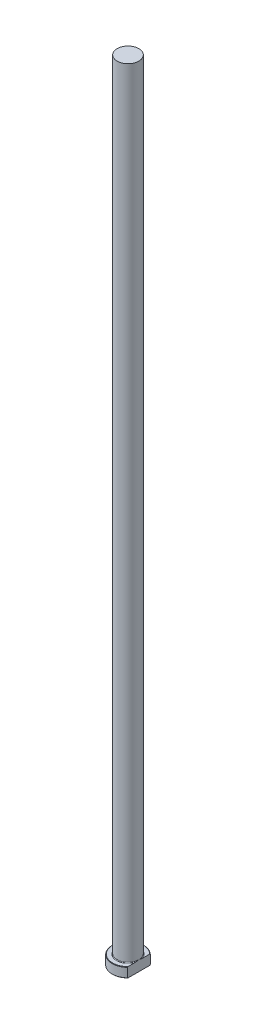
ISO-10303-21;
HEADER;
FILE_DESCRIPTION(('STEP AP214'),'2;1');
FILE_NAME('part.step','',(''),(''),'','','');
FILE_SCHEMA(('AUTOMOTIVE_DESIGN { 1 0 10303 214 1 1 1 1 }'));
ENDSEC;
DATA;
#1=APPLICATION_CONTEXT('core data for automotive mechanical design processes');
#2=APPLICATION_PROTOCOL_DEFINITION('international standard','automotive_design',2000,#1);
#3=PRODUCT_CONTEXT('',#1,'mechanical');
#4=PRODUCT('Part','Part','',(#3));
#5=PRODUCT_RELATED_PRODUCT_CATEGORY('part','',(#4));
#6=PRODUCT_DEFINITION_FORMATION('','',#4);
#7=PRODUCT_DEFINITION_CONTEXT('part definition',#1,'design');
#8=PRODUCT_DEFINITION('design','',#6,#7);
#9=PRODUCT_DEFINITION_SHAPE('','',#8);
#10=(LENGTH_UNIT() NAMED_UNIT(*) SI_UNIT(.MILLI.,.METRE.));
#11=(NAMED_UNIT(*) PLANE_ANGLE_UNIT() SI_UNIT($,.RADIAN.));
#12=(NAMED_UNIT(*) SI_UNIT($,.STERADIAN.) SOLID_ANGLE_UNIT());
#13=UNCERTAINTY_MEASURE_WITH_UNIT(LENGTH_MEASURE(1.E-05),#10,'distance_accuracy_value','');
#14=(GEOMETRIC_REPRESENTATION_CONTEXT(3) GLOBAL_UNCERTAINTY_ASSIGNED_CONTEXT((#13)) GLOBAL_UNIT_ASSIGNED_CONTEXT((#10,
#11,#12)) REPRESENTATION_CONTEXT('',''));
#15=CARTESIAN_POINT('',(0.,0.,0.));
#16=DIRECTION('',(0.,0.,1.));
#17=DIRECTION('',(1.,0.,0.));
#18=AXIS2_PLACEMENT_3D('',#15,#16,#17);
#19=CARTESIAN_POINT('',(0.,0.,0.));
#20=DIRECTION('',(0.,-1.,0.));
#21=DIRECTION('',(0.,0.,-1.));
#22=AXIS2_PLACEMENT_3D('',#19,#20,#21);
#23=PLANE('',#22);
#24=CARTESIAN_POINT('',(0.,0.,0.));
#25=DIRECTION('',(0.,-1.,0.));
#26=DIRECTION('',(0.,0.,-1.));
#27=AXIS2_PLACEMENT_3D('',#24,#25,#26);
#28=CIRCLE('',#27,7.79999999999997);
#29=CARTESIAN_POINT('',(5.49999999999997,0.,5.53082272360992));
#30=VERTEX_POINT('',#29);
#31=CARTESIAN_POINT('',(5.49999999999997,0.,-5.53082272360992));
#32=VERTEX_POINT('',#31);
#33=EDGE_CURVE('E98',#30,#32,#28,.T.);
#34=ORIENTED_EDGE('',*,*,#33,.T.);
#35=DIRECTION('',(0.,0.,1.));
#36=VECTOR('',#35,1.);
#37=CARTESIAN_POINT('',(5.49999999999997,0.,-5.80947501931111));
#38=LINE('',#37,#36);
#39=EDGE_CURVE('E83',#32,#30,#38,.T.);
#40=ORIENTED_EDGE('',*,*,#39,.T.);
#41=EDGE_LOOP('',(#34,#40));
#42=FACE_BOUND('',#41,.T.);
#43=ADVANCED_FACE('F32',(#42),#23,.T.);
#44=CARTESIAN_POINT('',(0.,259.958771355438,0.));
#45=DIRECTION('',(0.,1.,0.));
#46=DIRECTION('',(0.,0.,1.));
#47=AXIS2_PLACEMENT_3D('',#44,#45,#46);
#48=CYLINDRICAL_SURFACE('',#47,7.99999999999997);
#49=CARTESIAN_POINT('',(0.,4.79999999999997,0.));
#50=DIRECTION('',(0.,1.,0.));
#51=DIRECTION('',(0.,0.,1.));
#52=AXIS2_PLACEMENT_3D('',#49,#50,#51);
#53=CIRCLE('',#52,7.99999999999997);
#54=CARTESIAN_POINT('',(5.49999999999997,4.79999999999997,5.80947501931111));
#55=VERTEX_POINT('',#54);
#56=CARTESIAN_POINT('',(5.49999999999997,4.79999999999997,-5.80947501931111));
#57=VERTEX_POINT('',#56);
#58=EDGE_CURVE('E104',#55,#57,#53,.F.);
#59=ORIENTED_EDGE('',*,*,#58,.T.);
#60=DIRECTION('',(0.,-1.,0.));
#61=VECTOR('',#60,1.);
#62=CARTESIAN_POINT('',(5.49999999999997,400.,-5.80947501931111));
#63=LINE('',#62,#61);
#64=CARTESIAN_POINT('',(5.49999999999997,0.199999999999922,-5.80947501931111));
#65=VERTEX_POINT('',#64);
#66=EDGE_CURVE('E183',#57,#65,#63,.T.);
#67=ORIENTED_EDGE('',*,*,#66,.T.);
#68=CARTESIAN_POINT('',(0.,0.199999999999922,0.));
#69=DIRECTION('',(0.,-1.,0.));
#70=DIRECTION('',(0.,0.,-1.));
#71=AXIS2_PLACEMENT_3D('',#68,#69,#70);
#72=CIRCLE('',#71,7.99999999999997);
#73=CARTESIAN_POINT('',(5.49999999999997,0.199999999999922,5.80947501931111));
#74=VERTEX_POINT('',#73);
#75=EDGE_CURVE('E100',#65,#74,#72,.F.);
#76=ORIENTED_EDGE('',*,*,#75,.T.);
#77=DIRECTION('',(0.,-1.,0.));
#78=VECTOR('',#77,1.);
#79=CARTESIAN_POINT('',(5.49999999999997,400.,5.80947501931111));
#80=LINE('',#79,#78);
#81=EDGE_CURVE('E93',#55,#74,#80,.T.);
#82=ORIENTED_EDGE('',*,*,#81,.F.);
#83=EDGE_LOOP('',(#59,#67,#76,#82));
#84=FACE_BOUND('',#83,.T.);
#85=ADVANCED_FACE('F158',(#84),#48,.T.);
#86=CARTESIAN_POINT('',(-7.99999999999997,5.,0.));
#87=DIRECTION('',(0.,1.,0.));
#88=DIRECTION('',(0.,0.,1.));
#89=AXIS2_PLACEMENT_3D('',#86,#87,#88);
#90=PLANE('',#89);
#91=CARTESIAN_POINT('',(0.,5.,0.));
#92=DIRECTION('',(0.,1.,0.));
#93=DIRECTION('',(0.,0.,1.));
#94=AXIS2_PLACEMENT_3D('',#91,#92,#93);
#95=CIRCLE('',#94,7.79999999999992);
#96=CARTESIAN_POINT('',(5.49999999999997,5.,-5.53082272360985));
#97=VERTEX_POINT('',#96);
#98=CARTESIAN_POINT('',(5.49999999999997,5.,5.53082272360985));
#99=VERTEX_POINT('',#98);
#100=EDGE_CURVE('E178',#97,#99,#95,.T.);
#101=ORIENTED_EDGE('',*,*,#100,.T.);
#102=DIRECTION('',(0.,0.,-1.));
#103=VECTOR('',#102,1.);
#104=CARTESIAN_POINT('',(5.49999999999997,5.,0.));
#105=LINE('',#104,#103);
#106=CARTESIAN_POINT('',(5.49999999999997,4.99999999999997,1.84119526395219));
#107=VERTEX_POINT('',#106);
#108=EDGE_CURVE('E57',#99,#107,#105,.T.);
#109=ORIENTED_EDGE('',*,*,#108,.T.);
#110=CARTESIAN_POINT('',(0.,5.,0.));
#111=DIRECTION('',(0.,1.,0.));
#112=DIRECTION('',(0.,0.,1.));
#113=AXIS2_PLACEMENT_3D('',#110,#111,#112);
#114=CIRCLE('',#113,5.79999999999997);
#115=CARTESIAN_POINT('',(5.49999999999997,4.99999999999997,-1.84119526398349));
#116=VERTEX_POINT('',#115);
#117=EDGE_CURVE('E107',#107,#116,#114,.F.);
#118=ORIENTED_EDGE('',*,*,#117,.T.);
#119=EDGE_CURVE('E136',#116,#97,#105,.T.);
#120=ORIENTED_EDGE('',*,*,#119,.T.);
#121=EDGE_LOOP('',(#101,#109,#118,#120));
#122=FACE_BOUND('',#121,.T.);
#123=ADVANCED_FACE('F147',(#122),#90,.T.);
#124=CARTESIAN_POINT('',(0.,5.,0.));
#125=DIRECTION('',(0.,-1.,0.));
#126=DIRECTION('',(0.,0.,-1.));
#127=AXIS2_PLACEMENT_3D('',#124,#125,#126);
#128=CONICAL_SURFACE('',#127,7.79999999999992,0.785398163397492);
#129=ORIENTED_EDGE('',*,*,#58,.F.);
#130=CARTESIAN_POINT('',(5.49999999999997,-1.1151540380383,12.7820777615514));
#131=CARTESIAN_POINT('',(5.49999999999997,-0.941517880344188,12.5930460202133));
#132=CARTESIAN_POINT('',(5.49999999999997,-0.768204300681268,12.4037180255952));
#133=CARTESIAN_POINT('',(5.49999999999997,-0.422318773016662,12.0243831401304));
#134=CARTESIAN_POINT('',(5.49999999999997,-0.249746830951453,11.8343762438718));
#135=CARTESIAN_POINT('',(5.49999999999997,0.266785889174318,11.2631256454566));
#136=CARTESIAN_POINT('',(5.49999999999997,0.60948457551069,10.8807378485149));
#137=CARTESIAN_POINT('',(5.49999999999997,1.29256544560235,10.1095655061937));
#138=CARTESIAN_POINT('',(5.49999999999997,1.63291928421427,9.72075580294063));
#139=CARTESIAN_POINT('',(5.49999999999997,2.30738282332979,8.93782165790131));
#140=CARTESIAN_POINT('',(5.49999999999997,2.64149328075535,8.54369787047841));
#141=CARTESIAN_POINT('',(5.49999999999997,3.24251408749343,7.81851180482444));
#142=CARTESIAN_POINT('',(5.49999999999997,3.51085021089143,7.48863708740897));
#143=CARTESIAN_POINT('',(5.49999999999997,3.90712731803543,6.98880713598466));
#144=CARTESIAN_POINT('',(5.49999999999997,4.03820076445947,6.82133570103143));
#145=CARTESIAN_POINT('',(5.49999999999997,4.29784042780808,6.48446279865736));
#146=CARTESIAN_POINT('',(5.49999999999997,4.4264067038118,6.31506137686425));
#147=CARTESIAN_POINT('',(5.49999999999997,4.68038690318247,5.97419641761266));
#148=CARTESIAN_POINT('',(5.49999999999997,4.80580413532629,5.80273535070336));
#149=CARTESIAN_POINT('',(5.49999999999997,5.0529733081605,5.45719748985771));
#150=CARTESIAN_POINT('',(5.49999999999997,5.17472543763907,5.2831208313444));
#151=CARTESIAN_POINT('',(5.49999999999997,5.41367984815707,4.93196486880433));
#152=CARTESIAN_POINT('',(5.49999999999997,5.53088395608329,4.75488681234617));
#153=CARTESIAN_POINT('',(5.49999999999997,5.75968250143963,4.3971560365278));
#154=CARTESIAN_POINT('',(5.49999999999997,5.87127761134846,4.21650374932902));
#155=CARTESIAN_POINT('',(5.49999999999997,6.08629942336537,3.85292662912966));
#156=CARTESIAN_POINT('',(5.49999999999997,6.18979942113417,3.67004539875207));
#157=CARTESIAN_POINT('',(5.49999999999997,6.3880899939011,3.29955746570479));
#158=CARTESIAN_POINT('',(5.49999999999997,6.48287965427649,3.11195026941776));
#159=CARTESIAN_POINT('',(5.49999999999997,6.66127167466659,2.73169295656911));
#160=CARTESIAN_POINT('',(5.49999999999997,6.74488626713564,2.53904863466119));
#161=CARTESIAN_POINT('',(5.49999999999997,6.89808375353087,2.14822839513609));
#162=CARTESIAN_POINT('',(5.49999999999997,6.96767069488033,1.95005409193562));
#163=CARTESIAN_POINT('',(5.49999999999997,7.07670147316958,1.59030424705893));
#164=CARTESIAN_POINT('',(5.49999999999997,7.11940527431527,1.42972239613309));
#165=CARTESIAN_POINT('',(5.49999999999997,7.19217730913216,1.10570020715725));
#166=CARTESIAN_POINT('',(5.49999999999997,7.22224726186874,0.942260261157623));
#167=CARTESIAN_POINT('',(5.49999999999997,7.2682331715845,0.61383269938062));
#168=CARTESIAN_POINT('',(5.49999999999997,7.28418798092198,0.448850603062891));
#169=CARTESIAN_POINT('',(5.49999999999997,7.30121051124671,0.11811180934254));
#170=CARTESIAN_POINT('',(5.49999999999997,7.30227865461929,-0.0476448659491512));
#171=CARTESIAN_POINT('',(5.49999999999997,7.28946437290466,-0.378643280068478));
#172=CARTESIAN_POINT('',(5.49999999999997,7.27557532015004,-0.543884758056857));
#173=CARTESIAN_POINT('',(5.49999999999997,7.23360586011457,-0.872541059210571));
#174=CARTESIAN_POINT('',(5.49999999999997,7.2055242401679,-1.03595572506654));
#175=CARTESIAN_POINT('',(5.49999999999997,7.13645491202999,-1.36050703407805));
#176=CARTESIAN_POINT('',(5.49999999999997,7.09542895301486,-1.52163542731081));
#177=CARTESIAN_POINT('',(5.49999999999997,7.0022009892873,-1.84058362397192));
#178=CARTESIAN_POINT('',(5.49999999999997,6.94999898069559,-1.99840342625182));
#179=CARTESIAN_POINT('',(5.49999999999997,6.82412729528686,-2.34351289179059));
#180=CARTESIAN_POINT('',(5.49999999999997,6.74825204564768,-2.52999311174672));
#181=CARTESIAN_POINT('',(5.49999999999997,6.5853760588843,-2.89807095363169));
#182=CARTESIAN_POINT('',(5.49999999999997,6.49837001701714,-3.07966619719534));
#183=CARTESIAN_POINT('',(5.49999999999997,6.31536700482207,-3.43865575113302));
#184=CARTESIAN_POINT('',(5.49999999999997,6.2193537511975,-3.61604169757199));
#185=CARTESIAN_POINT('',(5.49999999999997,6.02029718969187,-3.96676299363));
#186=CARTESIAN_POINT('',(5.49999999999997,5.91725492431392,-4.14009893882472));
#187=CARTESIAN_POINT('',(5.49999999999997,5.70428964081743,-4.4852832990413));
#188=CARTESIAN_POINT('',(5.49999999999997,5.59430018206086,-4.65709053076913));
#189=CARTESIAN_POINT('',(5.49999999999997,5.36966321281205,-4.99762683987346));
#190=CARTESIAN_POINT('',(5.49999999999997,5.25501557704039,-5.1663558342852));
#191=CARTESIAN_POINT('',(5.49999999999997,5.02205528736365,-5.50098485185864));
#192=CARTESIAN_POINT('',(5.49999999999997,4.90374674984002,-5.66688774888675));
#193=CARTESIAN_POINT('',(5.49999999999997,4.66400808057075,-5.9964258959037));
#194=CARTESIAN_POINT('',(5.49999999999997,4.54257783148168,-6.16006106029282));
#195=CARTESIAN_POINT('',(5.49999999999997,4.20154795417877,-6.61207712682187));
#196=CARTESIAN_POINT('',(5.49999999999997,3.97915323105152,-6.89834873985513));
#197=CARTESIAN_POINT('',(5.49999999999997,3.52835863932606,-7.46612572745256));
#198=CARTESIAN_POINT('',(5.49999999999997,3.29995838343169,-7.74763079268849));
#199=CARTESIAN_POINT('',(5.49999999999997,2.83846100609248,-8.30706072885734));
#200=CARTESIAN_POINT('',(5.49999999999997,2.60536095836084,-8.58498318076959));
#201=CARTESIAN_POINT('',(5.49999999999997,2.13563301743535,-9.13783071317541));
#202=CARTESIAN_POINT('',(5.49999999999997,1.89900507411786,-9.41275575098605));
#203=CARTESIAN_POINT('',(5.49999999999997,1.43345389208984,-9.94811769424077));
#204=CARTESIAN_POINT('',(5.49999999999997,1.20465068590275,-10.2086591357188));
#205=CARTESIAN_POINT('',(5.49999999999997,0.744976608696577,-10.7279148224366));
#206=CARTESIAN_POINT('',(5.49999999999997,0.514105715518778,-10.9866290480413));
#207=CARTESIAN_POINT('',(5.49999999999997,0.0509694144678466,-11.5022006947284));
#208=CARTESIAN_POINT('',(5.49999999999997,-0.18129380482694,-11.7590600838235));
#209=CARTESIAN_POINT('',(5.49999999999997,-0.647231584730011,-12.2714820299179));
#210=CARTESIAN_POINT('',(5.49999999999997,-0.880906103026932,-12.5270446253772));
#211=CARTESIAN_POINT('',(5.49999999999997,-1.1151540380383,-12.7820777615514));
#212=B_SPLINE_CURVE_WITH_KNOTS('',3,(#130,#131,#132,#133,#134,#135,#136,#137,#138,#139,#140,
#141,#142,#143,#144,#145,#146,#147,#148,#149,#150,#151,#152,#153,#154,#155,#156,#157,#158,#159,
#160,#161,#162,#163,#164,#165,#166,#167,#168,#169,#170,#171,#172,#173,#174,#175,#176,#177,#178,
#179,#180,#181,#182,#183,#184,#185,#186,#187,#188,#189,#190,#191,#192,#193,#194,#195,#196,#197,
#198,#199,#200,#201,#202,#203,#204,#205,#206,#207,#208,#209,#210,#211),.UNSPECIFIED.,.F.,.F.,(4,
2,2,2,2,2,2,2,2,2,2,2,2,2,2,2,2,2,2,2,2,2,2,2,2,2,2,2,2,2,2,2,2,2,2,2,2,2,2,2,4),(0.,
0.770026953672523,1.54006005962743,3.080476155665,4.63063153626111,6.18059774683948,
7.45618053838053,8.09416066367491,8.73212573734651,9.3693897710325,10.006620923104,
10.6435933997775,11.2804893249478,11.9107163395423,12.5410094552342,13.1706068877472,
13.800022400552,14.2980757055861,14.7960612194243,15.2926717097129,15.7892681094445,
16.2860846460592,16.782943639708,17.2812848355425,17.7796262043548,18.3831348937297,
18.9869322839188,19.5918430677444,20.1966643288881,20.8085675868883,21.4204873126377,
22.031742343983,22.6430203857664,23.7304168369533,24.8178835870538,25.9060497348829,
26.99423135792,28.0344561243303,29.0746920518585,30.1135832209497,31.1524433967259),.UNSPECIFIED.);
#213=EDGE_CURVE('E135',#55,#99,#212,.T.);
#214=ORIENTED_EDGE('',*,*,#213,.T.);
#215=ORIENTED_EDGE('',*,*,#100,.F.);
#216=EDGE_CURVE('E127',#97,#57,#212,.T.);
#217=ORIENTED_EDGE('',*,*,#216,.T.);
#218=EDGE_LOOP('',(#129,#214,#215,#217));
#219=FACE_BOUND('',#218,.T.);
#220=ADVANCED_FACE('F143',(#219),#128,.T.);
#221=CARTESIAN_POINT('',(0.,0.199999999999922,0.));
#222=DIRECTION('',(0.,1.,0.));
#223=DIRECTION('',(0.,0.,1.));
#224=AXIS2_PLACEMENT_3D('',#221,#222,#223);
#225=CONICAL_SURFACE('',#224,7.99999999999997,0.78539816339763);
#226=ORIENTED_EDGE('',*,*,#75,.F.);
#227=CARTESIAN_POINT('',(5.49999999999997,6.11515403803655,-12.7820777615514));
#228=CARTESIAN_POINT('',(5.49999999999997,5.94151788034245,-12.5930460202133));
#229=CARTESIAN_POINT('',(5.49999999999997,5.76820430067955,-12.4037180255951));
#230=CARTESIAN_POINT('',(5.49999999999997,5.42231877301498,-12.0243831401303));
#231=CARTESIAN_POINT('',(5.49999999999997,5.24974683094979,-11.8343762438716));
#232=CARTESIAN_POINT('',(5.49999999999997,4.73321411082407,-11.2631256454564));
#233=CARTESIAN_POINT('',(5.49999999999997,4.39051542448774,-10.8807378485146));
#234=CARTESIAN_POINT('',(5.49999999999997,3.70743455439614,-10.1095655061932));
#235=CARTESIAN_POINT('',(5.49999999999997,3.36708071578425,-9.72075580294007));
#236=CARTESIAN_POINT('',(5.49999999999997,2.6926171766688,-8.93782165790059));
#237=CARTESIAN_POINT('',(5.49999999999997,2.35850671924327,-8.54369787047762));
#238=CARTESIAN_POINT('',(5.49999999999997,1.75748591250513,-7.81851180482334));
#239=CARTESIAN_POINT('',(5.49999999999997,1.48914978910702,-7.48863708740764));
#240=CARTESIAN_POINT('',(5.49999999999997,1.09287268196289,-6.98880713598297));
#241=CARTESIAN_POINT('',(5.49999999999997,0.961799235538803,-6.82133570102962));
#242=CARTESIAN_POINT('',(5.49999999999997,0.702159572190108,-6.4844627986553));
#243=CARTESIAN_POINT('',(5.49999999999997,0.573593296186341,-6.31506137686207));
#244=CARTESIAN_POINT('',(5.49999999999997,0.319613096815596,-5.97419641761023));
#245=CARTESIAN_POINT('',(5.49999999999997,0.194195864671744,-5.8027353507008));
#246=CARTESIAN_POINT('',(5.49999999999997,-0.0529733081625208,-5.4571974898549));
#247=CARTESIAN_POINT('',(5.49999999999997,-0.174725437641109,-5.28312083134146));
#248=CARTESIAN_POINT('',(5.49999999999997,-0.413679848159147,-4.93196486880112));
#249=CARTESIAN_POINT('',(5.49999999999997,-0.530883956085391,-4.75488681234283));
#250=CARTESIAN_POINT('',(5.49999999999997,-0.759682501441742,-4.39715603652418));
#251=CARTESIAN_POINT('',(5.49999999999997,-0.871277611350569,-4.21650374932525));
#252=CARTESIAN_POINT('',(5.49999999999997,-1.08629942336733,-3.8529266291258));
#253=CARTESIAN_POINT('',(5.49999999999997,-1.18979942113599,-3.67004539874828));
#254=CARTESIAN_POINT('',(5.49999999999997,-1.38808999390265,-3.29955746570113));
#255=CARTESIAN_POINT('',(5.49999999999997,-1.4828796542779,-3.11195026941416));
#256=CARTESIAN_POINT('',(5.49999999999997,-1.66127167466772,-2.73169295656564));
#257=CARTESIAN_POINT('',(5.49999999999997,-1.74488626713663,-2.5390486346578));
#258=CARTESIAN_POINT('',(5.49999999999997,-1.89808375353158,-2.14822839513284));
#259=CARTESIAN_POINT('',(5.49999999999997,-1.9676706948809,-1.95005409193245));
#260=CARTESIAN_POINT('',(5.49999999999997,-2.07670147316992,-1.59030424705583));
#261=CARTESIAN_POINT('',(5.49999999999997,-2.11940527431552,-1.42972239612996));
#262=CARTESIAN_POINT('',(5.49999999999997,-2.19217730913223,-1.10570020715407));
#263=CARTESIAN_POINT('',(5.49999999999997,-2.22224726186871,-0.942260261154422));
#264=CARTESIAN_POINT('',(5.49999999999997,-2.26823317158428,-0.613832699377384));
#265=CARTESIAN_POINT('',(5.49999999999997,-2.28418798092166,-0.448850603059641));
#266=CARTESIAN_POINT('',(5.49999999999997,-2.30121051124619,-0.11811180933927));
#267=CARTESIAN_POINT('',(5.49999999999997,-2.30227865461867,0.0476448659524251));
#268=CARTESIAN_POINT('',(5.49999999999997,-2.28946437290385,0.378643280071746));
#269=CARTESIAN_POINT('',(5.49999999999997,-2.27557532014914,0.543884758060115));
#270=CARTESIAN_POINT('',(5.49999999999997,-2.23360586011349,0.8725410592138));
#271=CARTESIAN_POINT('',(5.49999999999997,-2.20552424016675,1.03595572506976));
#272=CARTESIAN_POINT('',(5.49999999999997,-2.13645491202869,1.36050703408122));
#273=CARTESIAN_POINT('',(5.49999999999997,-2.09542895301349,1.52163542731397));
#274=CARTESIAN_POINT('',(5.49999999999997,-2.00220098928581,1.84058362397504));
#275=CARTESIAN_POINT('',(5.49999999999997,-1.94999898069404,1.99840342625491));
#276=CARTESIAN_POINT('',(5.49999999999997,-1.82412729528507,2.343512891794));
#277=CARTESIAN_POINT('',(5.49999999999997,-1.74825204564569,2.52999311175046));
#278=CARTESIAN_POINT('',(5.49999999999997,-1.58537605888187,2.89807095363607));
#279=CARTESIAN_POINT('',(5.49999999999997,-1.49837001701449,3.07966619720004));
#280=CARTESIAN_POINT('',(5.49999999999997,-1.31536700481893,3.43865575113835));
#281=CARTESIAN_POINT('',(5.49999999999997,-1.21935375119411,3.61604169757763));
#282=CARTESIAN_POINT('',(5.49999999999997,-1.02029718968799,3.96676299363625));
#283=CARTESIAN_POINT('',(5.49999999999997,-0.917254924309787,4.14009893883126));
#284=CARTESIAN_POINT('',(5.49999999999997,-0.704289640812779,4.48528329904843));
#285=CARTESIAN_POINT('',(5.49999999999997,-0.59430018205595,4.65709053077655));
#286=CARTESIAN_POINT('',(5.49999999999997,-0.369663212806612,4.99762683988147));
#287=CARTESIAN_POINT('',(5.49999999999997,-0.255015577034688,5.1663558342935));
#288=CARTESIAN_POINT('',(5.49999999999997,-0.0220552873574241,5.50098485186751));
#289=CARTESIAN_POINT('',(5.49999999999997,0.0962532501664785,5.66688774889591));
#290=CARTESIAN_POINT('',(5.49999999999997,0.335991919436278,5.99642589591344));
#291=CARTESIAN_POINT('',(5.49999999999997,0.457422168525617,6.16006106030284));
#292=CARTESIAN_POINT('',(5.49999999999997,0.79845204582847,6.61207712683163));
#293=CARTESIAN_POINT('',(5.49999999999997,1.02084676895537,6.89834873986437));
#294=CARTESIAN_POINT('',(5.49999999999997,1.4716413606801,7.46612572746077));
#295=CARTESIAN_POINT('',(5.49999999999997,1.70004161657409,7.74763079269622));
#296=CARTESIAN_POINT('',(5.49999999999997,2.16153899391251,8.30706072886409));
#297=CARTESIAN_POINT('',(5.49999999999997,2.39463904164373,8.58498318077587));
#298=CARTESIAN_POINT('',(5.49999999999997,2.86436698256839,9.13783071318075));
#299=CARTESIAN_POINT('',(5.49999999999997,3.10099492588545,9.41275575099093));
#300=CARTESIAN_POINT('',(5.49999999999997,3.56654610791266,9.94811769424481));
#301=CARTESIAN_POINT('',(5.49999999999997,3.79534931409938,10.2086591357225));
#302=CARTESIAN_POINT('',(5.49999999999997,4.25502339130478,10.7279148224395));
#303=CARTESIAN_POINT('',(5.49999999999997,4.4858942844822,10.9866290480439));
#304=CARTESIAN_POINT('',(5.49999999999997,4.94903058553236,11.5022006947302));
#305=CARTESIAN_POINT('',(5.49999999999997,5.18129380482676,11.7590600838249));
#306=CARTESIAN_POINT('',(5.49999999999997,5.64723158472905,12.2714820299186));
#307=CARTESIAN_POINT('',(5.49999999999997,5.88090610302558,12.5270446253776));
#308=CARTESIAN_POINT('',(5.49999999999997,6.11515403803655,12.7820777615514));
#309=B_SPLINE_CURVE_WITH_KNOTS('',3,(#227,#228,#229,#230,#231,#232,#233,#234,#235,#236,#237,
#238,#239,#240,#241,#242,#243,#244,#245,#246,#247,#248,#249,#250,#251,#252,#253,#254,#255,#256,
#257,#258,#259,#260,#261,#262,#263,#264,#265,#266,#267,#268,#269,#270,#271,#272,#273,#274,#275,
#276,#277,#278,#279,#280,#281,#282,#283,#284,#285,#286,#287,#288,#289,#290,#291,#292,#293,#294,
#295,#296,#297,#298,#299,#300,#301,#302,#303,#304,#305,#306,#307,#308),.UNSPECIFIED.,.F.,.F.,(4,
2,2,2,2,2,2,2,2,2,2,2,2,2,2,2,2,2,2,2,2,2,2,2,2,2,2,2,2,2,2,2,2,2,2,2,2,2,2,2,4),(0.,
0.770026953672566,1.54006005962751,3.08047615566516,4.63063153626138,6.18059774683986,
7.45618053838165,8.09416066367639,8.73212573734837,9.36938977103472,10.0066209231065,
10.6435933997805,11.2804893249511,11.9107163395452,12.5410094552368,13.1706068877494,
13.8000224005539,14.298075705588,14.7960612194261,15.2926717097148,15.7892681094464,
16.2860846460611,16.7829436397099,17.2812848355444,17.7796262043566,18.3831348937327,
18.9869322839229,19.5918430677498,20.1966643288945,20.8085675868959,21.4204873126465,
22.0317423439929,22.6430203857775,23.7304168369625,24.8178835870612,25.9060497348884,
26.9942313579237,28.0344561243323,29.0746920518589,30.1135832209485,31.1524433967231),.UNSPECIFIED.);
#310=EDGE_CURVE('E86',#65,#32,#309,.T.);
#311=ORIENTED_EDGE('',*,*,#310,.T.);
#312=ORIENTED_EDGE('',*,*,#33,.F.);
#313=EDGE_CURVE('E89',#30,#74,#309,.T.);
#314=ORIENTED_EDGE('',*,*,#313,.T.);
#315=EDGE_LOOP('',(#226,#311,#312,#314));
#316=FACE_BOUND('',#315,.T.);
#317=ADVANCED_FACE('F97',(#316),#225,.T.);
#318=CARTESIAN_POINT('',(0.,5.29999999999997,0.));
#319=DIRECTION('',(0.,1.,0.));
#320=DIRECTION('',(0.,0.,1.));
#321=AXIS2_PLACEMENT_3D('',#318,#319,#320);
#322=TOROIDAL_SURFACE('',#321,5.79999999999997,0.3);
#323=CARTESIAN_POINT('',(5.49999999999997,5.29999999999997,0.));
#324=CARTESIAN_POINT('',(5.49999999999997,5.30000062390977,1.37321730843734E-10));
#325=CARTESIAN_POINT('',(5.49999999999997,5.30000124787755,-2.69376376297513E-07));
#326=CARTESIAN_POINT('',(5.49999999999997,5.30000240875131,-9.99151691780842E-07));
#327=CARTESIAN_POINT('',(5.49999999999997,5.30000292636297,-1.47834826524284E-06));
#328=CARTESIAN_POINT('',(5.49999999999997,5.30000401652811,-2.63038637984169E-06));
#329=CARTESIAN_POINT('',(5.49999999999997,5.3000045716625,-3.32194614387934E-06));
#330=CARTESIAN_POINT('',(5.49999999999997,5.30000555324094,-4.74435536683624E-06));
#331=CARTESIAN_POINT('',(5.49999999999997,5.30000598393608,-5.47253605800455E-06));
#332=CARTESIAN_POINT('',(5.49999999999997,5.30000761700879,-8.33560288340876E-06));
#333=CARTESIAN_POINT('',(5.49999999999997,5.30000873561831,-1.05221151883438E-05));
#334=CARTESIAN_POINT('',(5.49999999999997,5.30001054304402,-1.48184286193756E-05));
#335=CARTESIAN_POINT('',(5.49999999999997,5.30001126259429,-1.69157853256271E-05));
#336=CARTESIAN_POINT('',(5.49999999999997,5.30001433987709,-2.59119235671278E-05));
#337=CARTESIAN_POINT('',(5.49999999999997,5.30001667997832,-3.28197570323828E-05));
#338=CARTESIAN_POINT('',(5.49999999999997,5.30002006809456,-4.57841698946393E-05));
#339=CARTESIAN_POINT('',(5.49999999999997,5.30002126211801,-5.18021293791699E-05));
#340=CARTESIAN_POINT('',(5.49999999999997,5.30003004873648,-9.68722229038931E-05));
#341=CARTESIAN_POINT('',(5.49999999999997,5.30003680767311,-0.000136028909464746));
#342=CARTESIAN_POINT('',(5.49999999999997,5.30006639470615,-0.000291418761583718));
#343=CARTESIAN_POINT('',(5.49999999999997,5.30009452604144,-0.000406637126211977));
#344=CARTESIAN_POINT('',(5.49999999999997,5.30020462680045,-0.000864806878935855));
#345=CARTESIAN_POINT('',(5.49999999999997,5.30028324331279,-0.00120829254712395));
#346=CARTESIAN_POINT('',(5.49999999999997,5.3005992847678,-0.00257937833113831));
#347=CARTESIAN_POINT('',(5.49999999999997,5.300840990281,-0.00360627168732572));
#348=CARTESIAN_POINT('',(5.49999999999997,5.30184970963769,-0.00790277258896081));
#349=CARTESIAN_POINT('',(5.49999999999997,5.30261131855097,-0.0111732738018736));
#350=CARTESIAN_POINT('',(5.49999999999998,5.30969442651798,-0.0415753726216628));
#351=CARTESIAN_POINT('',(5.49999999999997,5.31603915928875,-0.0687032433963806));
#352=CARTESIAN_POINT('',(5.49999999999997,5.32843561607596,-0.121865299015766));
#353=CARTESIAN_POINT('',(5.49999999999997,5.33448878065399,-0.147899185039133));
#354=CARTESIAN_POINT('',(5.49999999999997,5.34733836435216,-0.203330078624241));
#355=CARTESIAN_POINT('',(5.49999999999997,5.35413005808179,-0.232728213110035));
#356=CARTESIAN_POINT('',(5.49999999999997,5.36771480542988,-0.29186839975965));
#357=CARTESIAN_POINT('',(5.49999999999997,5.37450703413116,-0.321610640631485));
#358=CARTESIAN_POINT('',(5.49999999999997,5.3907398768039,-0.393246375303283));
#359=CARTESIAN_POINT('',(5.49999999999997,5.40013144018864,-0.435151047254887));
#360=CARTESIAN_POINT('',(5.49999999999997,5.41839331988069,-0.517899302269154));
#361=CARTESIAN_POINT('',(5.49999999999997,5.42727085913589,-0.558741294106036));
#362=CARTESIAN_POINT('',(5.49999999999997,5.45304047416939,-0.679649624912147));
#363=CARTESIAN_POINT('',(5.49999999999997,5.46946475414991,-0.759817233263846));
#364=CARTESIAN_POINT('',(5.49999999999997,5.50059525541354,-0.921248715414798));
#365=CARTESIAN_POINT('',(5.49999999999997,5.5152844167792,-1.00251591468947));
#366=CARTESIAN_POINT('',(5.49999999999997,5.54326935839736,-1.17291320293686));
#367=CARTESIAN_POINT('',(5.49999999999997,5.55631639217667,-1.2620853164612));
#368=CARTESIAN_POINT('',(5.49999999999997,5.57807460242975,-1.4407267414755));
#369=CARTESIAN_POINT('',(5.49999999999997,5.5867974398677,-1.53019459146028));
#370=CARTESIAN_POINT('',(5.49999999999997,5.59813646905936,-1.70678130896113));
#371=CARTESIAN_POINT('',(5.49999999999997,5.60093453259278,-1.79388646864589));
#372=CARTESIAN_POINT('',(5.49999999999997,5.59913730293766,-1.92371114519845));
#373=CARTESIAN_POINT('',(5.49999999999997,5.59757869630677,-1.96647130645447));
#374=CARTESIAN_POINT('',(5.49999999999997,5.59207086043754,-2.0518267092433));
#375=CARTESIAN_POINT('',(5.49999999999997,5.58812304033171,-2.09442203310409));
#376=CARTESIAN_POINT('',(5.49999999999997,5.57845042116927,-2.16952357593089));
#377=CARTESIAN_POINT('',(5.49999999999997,5.57333912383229,-2.20210765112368));
#378=CARTESIAN_POINT('',(5.49999999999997,5.56085936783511,-2.26696451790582));
#379=CARTESIAN_POINT('',(5.49999999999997,5.55348387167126,-2.29923601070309));
#380=CARTESIAN_POINT('',(5.49999999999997,5.53578949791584,-2.36314331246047));
#381=CARTESIAN_POINT('',(5.49999999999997,5.52545654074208,-2.39477528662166));
#382=CARTESIAN_POINT('',(5.49999999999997,5.50076223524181,-2.45658585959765));
#383=CARTESIAN_POINT('',(5.49999999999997,5.48639841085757,-2.48676355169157));
#384=CARTESIAN_POINT('',(5.49999999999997,5.45845930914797,-2.53258359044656));
#385=CARTESIAN_POINT('',(5.49999999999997,5.4467285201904,-2.54933279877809));
#386=CARTESIAN_POINT('',(5.49999999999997,5.42036237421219,-2.58032609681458));
#387=CARTESIAN_POINT('',(5.49999999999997,5.40575448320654,-2.59459164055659));
#388=CARTESIAN_POINT('',(5.49999999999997,5.38269146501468,-2.61139952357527));
#389=CARTESIAN_POINT('',(5.49999999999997,5.37567288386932,-2.6159011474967));
#390=CARTESIAN_POINT('',(5.49999999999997,5.36105421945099,-2.62385691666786));
#391=CARTESIAN_POINT('',(5.49999999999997,5.35345422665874,-2.62731122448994));
#392=CARTESIAN_POINT('',(5.49999999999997,5.33769516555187,-2.63292915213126));
#393=CARTESIAN_POINT('',(5.49999999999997,5.32953131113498,-2.63507966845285));
#394=CARTESIAN_POINT('',(5.49999999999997,5.31294528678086,-2.63780090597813));
#395=CARTESIAN_POINT('',(5.49999999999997,5.3045234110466,-2.63837336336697));
#396=CARTESIAN_POINT('',(5.49999999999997,5.28851094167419,-2.63789663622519));
#397=CARTESIAN_POINT('',(5.49999999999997,5.2809155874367,-2.63699270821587));
#398=CARTESIAN_POINT('',(5.49999999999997,5.26598512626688,-2.63392394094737));
#399=CARTESIAN_POINT('',(5.49999999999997,5.25865020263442,-2.6317582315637));
#400=CARTESIAN_POINT('',(5.49999999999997,5.24234078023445,-2.62556604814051));
#401=CARTESIAN_POINT('',(5.49999999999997,5.23350275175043,-2.62118324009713));
#402=CARTESIAN_POINT('',(5.49999999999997,5.21664244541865,-2.61106244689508));
#403=CARTESIAN_POINT('',(5.49999999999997,5.20862200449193,-2.60532150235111));
#404=CARTESIAN_POINT('',(5.49999999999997,5.18881724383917,-2.58912168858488));
#405=CARTESIAN_POINT('',(5.49999999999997,5.17766341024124,-2.57789934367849));
#406=CARTESIAN_POINT('',(5.49999999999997,5.15712865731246,-2.55396421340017));
#407=CARTESIAN_POINT('',(5.49999999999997,5.14775124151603,-2.54124856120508));
#408=CARTESIAN_POINT('',(5.49999999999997,5.1219531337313,-2.50201772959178));
#409=CARTESIAN_POINT('',(5.49999999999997,5.10760202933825,-2.47415772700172));
#410=CARTESIAN_POINT('',(5.49999999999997,5.08264412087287,-2.4167036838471));
#411=CARTESIAN_POINT('',(5.49999999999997,5.07206513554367,-2.38709856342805));
#412=CARTESIAN_POINT('',(5.49999999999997,5.04919805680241,-2.31224104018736));
#413=CARTESIAN_POINT('',(5.49999999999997,5.0386368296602,-2.26646729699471));
#414=CARTESIAN_POINT('',(5.49999999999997,5.02182095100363,-2.17406875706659));
#415=CARTESIAN_POINT('',(5.49999999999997,5.01557941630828,-2.12744180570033));
#416=CARTESIAN_POINT('',(5.49999999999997,5.00649716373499,-2.0351579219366));
#417=CARTESIAN_POINT('',(5.49999999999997,5.00356804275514,-1.98950936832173));
#418=CARTESIAN_POINT('',(5.49999999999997,5.00016782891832,-1.8983460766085));
#419=CARTESIAN_POINT('',(5.49999999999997,4.99968533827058,-1.85283170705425));
#420=CARTESIAN_POINT('',(5.49999999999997,5.00090888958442,-1.74240379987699));
#421=CARTESIAN_POINT('',(5.49999999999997,5.00363706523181,-1.67750284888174));
#422=CARTESIAN_POINT('',(5.49999999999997,5.01218141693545,-1.54793822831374));
#423=CARTESIAN_POINT('',(5.49999999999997,5.01799679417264,-1.48327450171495));
#424=CARTESIAN_POINT('',(5.49999999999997,5.03222723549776,-1.35268561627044));
#425=CARTESIAN_POINT('',(5.49999999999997,5.0407007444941,-1.28676695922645));
#426=CARTESIAN_POINT('',(5.49999999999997,5.05968062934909,-1.1550540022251));
#427=CARTESIAN_POINT('',(5.49999999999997,5.07019222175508,-1.08926046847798));
#428=CARTESIAN_POINT('',(5.49999999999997,5.09695256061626,-0.933785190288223));
#429=CARTESIAN_POINT('',(5.49999999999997,5.11388903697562,-0.844222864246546));
#430=CARTESIAN_POINT('',(5.49999999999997,5.14958548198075,-0.666532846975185));
#431=CARTESIAN_POINT('',(5.49999999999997,5.1683224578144,-0.578400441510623));
#432=CARTESIAN_POINT('',(5.49999999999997,5.20478806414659,-0.412629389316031));
#433=CARTESIAN_POINT('',(5.49999999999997,5.22238111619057,-0.334960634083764));
#434=CARTESIAN_POINT('',(5.49999999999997,5.24959866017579,-0.216510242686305));
#435=CARTESIAN_POINT('',(5.49999999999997,5.25904905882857,-0.175687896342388));
#436=CARTESIAN_POINT('',(5.49999999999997,5.27788780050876,-0.0947269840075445));
#437=CARTESIAN_POINT('',(5.49999999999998,5.28727465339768,-0.0545880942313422));
#438=CARTESIAN_POINT('',(5.49999999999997,5.29739035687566,-0.0111657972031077));
#439=CARTESIAN_POINT('',(5.49999999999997,5.29815375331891,-0.00788783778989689));
#440=CARTESIAN_POINT('',(5.49999999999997,5.29916288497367,-0.00358966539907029));
#441=CARTESIAN_POINT('',(5.49999999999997,5.29940322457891,-0.00256856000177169));
#442=CARTESIAN_POINT('',(5.49999999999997,5.2997176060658,-0.00120467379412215));
#443=CARTESIAN_POINT('',(5.49999999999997,5.29979589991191,-0.000862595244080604));
#444=CARTESIAN_POINT('',(5.49999999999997,5.29990561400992,-0.000406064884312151));
#445=CARTESIAN_POINT('',(5.49999999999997,5.2999336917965,-0.000291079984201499));
#446=CARTESIAN_POINT('',(5.49999999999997,5.29996322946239,-0.000135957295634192));
#447=CARTESIAN_POINT('',(5.49999999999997,5.29996998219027,-9.68324215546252E-05));
#448=CARTESIAN_POINT('',(5.49999999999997,5.29997875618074,-5.17949381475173E-05));
#449=CARTESIAN_POINT('',(5.49999999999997,5.29997994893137,-4.57786558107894E-05));
#450=CARTESIAN_POINT('',(5.49999999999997,5.29998333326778,-3.28177654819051E-05));
#451=CARTESIAN_POINT('',(5.49999999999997,5.2999856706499,-2.59116891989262E-05));
#452=CARTESIAN_POINT('',(5.49999999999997,5.29998874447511,-1.69173980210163E-05));
#453=CARTESIAN_POINT('',(5.49999999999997,5.29998946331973,-1.4820166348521E-05));
#454=CARTESIAN_POINT('',(5.49999999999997,5.29999126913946,-1.05239951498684E-05));
#455=CARTESIAN_POINT('',(5.49999999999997,5.29999238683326,-8.33748307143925E-06));
#456=CARTESIAN_POINT('',(5.49999999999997,5.29999401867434,-5.47429219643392E-06));
#457=CARTESIAN_POINT('',(5.49999999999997,5.29999444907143,-4.74604003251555E-06));
#458=CARTESIAN_POINT('',(5.49999999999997,5.29999543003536,-3.32343406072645E-06));
#459=CARTESIAN_POINT('',(5.49999999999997,5.29999598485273,-2.63174656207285E-06));
#460=CARTESIAN_POINT('',(5.49999999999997,5.29999707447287,-1.47941235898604E-06));
#461=CARTESIAN_POINT('',(5.49999999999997,5.29999759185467,-1.00005962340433E-06));
#462=CARTESIAN_POINT('',(5.49999999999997,5.29999875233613,-2.69883386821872E-07));
#463=CARTESIAN_POINT('',(5.49999999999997,5.29999937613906,-1.37310971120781E-10));
#464=CARTESIAN_POINT('',(5.49999999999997,5.29999999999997,0.));
#465=B_SPLINE_CURVE_WITH_KNOTS('',3,(#323,#324,#325,#326,#327,#328,#329,#330,#331,#332,#333,
#334,#335,#336,#337,#338,#339,#340,#341,#342,#343,#344,#345,#346,#347,#348,#349,#350,#351,#352,
#353,#354,#355,#356,#357,#358,#359,#360,#361,#362,#363,#364,#365,#366,#367,#368,#369,#370,#371,
#372,#373,#374,#375,#376,#377,#378,#379,#380,#381,#382,#383,#384,#385,#386,#387,#388,#389,#390,
#391,#392,#393,#394,#395,#396,#397,#398,#399,#400,#401,#402,#403,#404,#405,#406,#407,#408,#409,
#410,#411,#412,#413,#414,#415,#416,#417,#418,#419,#420,#421,#422,#423,#424,#425,#426,#427,#428,
#429,#430,#431,#432,#433,#434,#435,#436,#437,#438,#439,#440,#441,#442,#443,#444,#445,#446,#447,
#448,#449,#450,#451,#452,#453,#454,#455,#456,#457,#458,#459,#460,#461,#462,#463,#464),
.UNSPECIFIED.,.T.,.F.,(4,2,2,2,2,2,2,2,2,2,2,2,2,2,2,2,2,2,2,2,2,2,2,2,2,2,2,2,2,2,2,2,2,2,2,2,
2,2,2,2,2,2,2,2,2,2,2,2,2,2,2,2,2,2,2,2,2,2,2,2,2,2,2,2,2,2,2,2,2,2,4),(0.,1.89759089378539E-06,
4.0217832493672E-06,6.66436842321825E-06,9.20151056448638E-06,1.65449719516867E-05,
2.31908325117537E-05,4.50383514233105E-05,6.34229836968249E-05,0.000182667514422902,
0.000538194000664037,0.00159559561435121,0.00476009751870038,0.0148345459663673,
0.0984122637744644,0.178597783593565,0.269114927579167,0.360638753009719,0.489470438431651,
0.61485697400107,0.860339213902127,1.10806331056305,1.37834904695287,1.64790189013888,
1.90905265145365,2.03736998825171,2.16561171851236,2.26450233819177,2.36370349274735,
2.46338500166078,2.56312787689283,2.62428570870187,2.68488576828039,2.7098322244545,
2.73477480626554,2.75996408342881,2.78512563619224,2.80795720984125,2.8308045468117,
2.86023439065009,2.88972896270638,2.93692759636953,2.98421836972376,3.07771161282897,
3.17188074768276,3.31245630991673,3.45345688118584,3.59059834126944,3.7271003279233,
3.92187072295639,4.11659074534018,4.31593390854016,4.51579419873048,4.78920516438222,
5.05949875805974,5.29840417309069,5.42411083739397,5.54777320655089,5.55787065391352,
5.56101731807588,5.56207038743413,5.56242519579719,5.56254434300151,5.56256272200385,
5.56258456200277,5.56259120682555,5.56259854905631,5.56260108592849,5.56260372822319,
5.56260585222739,5.5626077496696),.UNSPECIFIED.);
#466=CARTESIAN_POINT('',(5.49999999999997,5.29999999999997,0.));
#467=VERTEX_POINT('',#466);
#468=EDGE_CURVE('E11',#116,#467,#465,.T.);
#469=ORIENTED_EDGE('',*,*,#468,.F.);
#470=ORIENTED_EDGE('',*,*,#117,.F.);
#471=CARTESIAN_POINT('',(5.49999999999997,5.29999999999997,0.));
#472=CARTESIAN_POINT('',(5.49999999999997,5.29999937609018,-1.37321567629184E-10));
#473=CARTESIAN_POINT('',(5.49999999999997,5.29999875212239,2.69376376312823E-07));
#474=CARTESIAN_POINT('',(5.49999999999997,5.29999759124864,9.9915169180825E-07));
#475=CARTESIAN_POINT('',(5.49999999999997,5.29999707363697,1.47834826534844E-06));
#476=CARTESIAN_POINT('',(5.49999999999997,5.29999598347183,2.6303863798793E-06));
#477=CARTESIAN_POINT('',(5.49999999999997,5.29999542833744,3.32194614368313E-06));
#478=CARTESIAN_POINT('',(5.49999999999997,5.299994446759,4.74435536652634E-06));
#479=CARTESIAN_POINT('',(5.49999999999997,5.29999401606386,5.47253605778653E-06));
#480=CARTESIAN_POINT('',(5.49999999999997,5.29999238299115,8.33560288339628E-06));
#481=CARTESIAN_POINT('',(5.49999999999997,5.29999126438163,1.05221151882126E-05));
#482=CARTESIAN_POINT('',(5.49999999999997,5.29998945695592,1.48184286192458E-05));
#483=CARTESIAN_POINT('',(5.49999999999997,5.29998873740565,1.69157853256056E-05));
#484=CARTESIAN_POINT('',(5.49999999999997,5.29998566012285,2.59119235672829E-05));
#485=CARTESIAN_POINT('',(5.49999999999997,5.29998332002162,3.28197570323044E-05));
#486=CARTESIAN_POINT('',(5.49999999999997,5.29997993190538,4.57841698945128E-05));
#487=CARTESIAN_POINT('',(5.49999999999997,5.29997873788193,5.18021293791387E-05));
#488=CARTESIAN_POINT('',(5.49999999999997,5.29996995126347,9.68722229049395E-05));
#489=CARTESIAN_POINT('',(5.49999999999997,5.29996319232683,0.000136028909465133));
#490=CARTESIAN_POINT('',(5.49999999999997,5.29993360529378,0.000291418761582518));
#491=CARTESIAN_POINT('',(5.49999999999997,5.2999054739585,0.000406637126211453));
#492=CARTESIAN_POINT('',(5.49999999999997,5.2997953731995,0.000864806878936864));
#493=CARTESIAN_POINT('',(5.49999999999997,5.29971675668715,0.00120829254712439));
#494=CARTESIAN_POINT('',(5.49999999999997,5.29940071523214,0.00257937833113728));
#495=CARTESIAN_POINT('',(5.49999999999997,5.29915900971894,0.00360627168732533));
#496=CARTESIAN_POINT('',(5.49999999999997,5.29815029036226,0.00790277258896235));
#497=CARTESIAN_POINT('',(5.49999999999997,5.29738868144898,0.0111732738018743));
#498=CARTESIAN_POINT('',(5.49999999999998,5.29030557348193,0.0415753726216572));
#499=CARTESIAN_POINT('',(5.49999999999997,5.28396084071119,0.0687032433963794));
#500=CARTESIAN_POINT('',(5.49999999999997,5.27156438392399,0.121865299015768));
#501=CARTESIAN_POINT('',(5.49999999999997,5.26551121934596,0.147899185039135));
#502=CARTESIAN_POINT('',(5.49999999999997,5.25266163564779,0.203330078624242));
#503=CARTESIAN_POINT('',(5.49999999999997,5.24586994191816,0.232728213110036));
#504=CARTESIAN_POINT('',(5.49999999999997,5.23228519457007,0.291868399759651));
#505=CARTESIAN_POINT('',(5.49999999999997,5.22549296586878,0.321610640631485));
#506=CARTESIAN_POINT('',(5.49999999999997,5.20926012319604,0.393246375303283));
#507=CARTESIAN_POINT('',(5.49999999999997,5.1998685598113,0.435151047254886));
#508=CARTESIAN_POINT('',(5.49999999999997,5.18160668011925,0.517899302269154));
#509=CARTESIAN_POINT('',(5.49999999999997,5.17272914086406,0.558741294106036));
#510=CARTESIAN_POINT('',(5.49999999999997,5.14695952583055,0.679649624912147));
#511=CARTESIAN_POINT('',(5.49999999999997,5.13053524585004,0.759817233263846));
#512=CARTESIAN_POINT('',(5.49999999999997,5.09940474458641,0.921248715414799));
#513=CARTESIAN_POINT('',(5.49999999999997,5.08471558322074,1.00251591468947));
#514=CARTESIAN_POINT('',(5.49999999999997,5.05673064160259,1.17291320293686));
#515=CARTESIAN_POINT('',(5.49999999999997,5.04368360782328,1.2620853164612));
#516=CARTESIAN_POINT('',(5.49999999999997,5.0219253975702,1.4407267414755));
#517=CARTESIAN_POINT('',(5.49999999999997,5.01320256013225,1.53019459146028));
#518=CARTESIAN_POINT('',(5.49999999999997,5.00186353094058,1.70678130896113));
#519=CARTESIAN_POINT('',(5.49999999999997,4.99906546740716,1.79388646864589));
#520=CARTESIAN_POINT('',(5.49999999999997,5.00086269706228,1.92371114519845));
#521=CARTESIAN_POINT('',(5.49999999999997,5.00242130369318,1.96647130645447));
#522=CARTESIAN_POINT('',(5.49999999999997,5.00792913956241,2.0518267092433));
#523=CARTESIAN_POINT('',(5.49999999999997,5.01187695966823,2.09442203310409));
#524=CARTESIAN_POINT('',(5.49999999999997,5.02154957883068,2.16952357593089));
#525=CARTESIAN_POINT('',(5.49999999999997,5.02666087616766,2.20210765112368));
#526=CARTESIAN_POINT('',(5.49999999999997,5.03914063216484,2.26696451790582));
#527=CARTESIAN_POINT('',(5.49999999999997,5.04651612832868,2.29923601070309));
#528=CARTESIAN_POINT('',(5.49999999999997,5.0642105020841,2.36314331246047));
#529=CARTESIAN_POINT('',(5.49999999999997,5.07454345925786,2.39477528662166));
#530=CARTESIAN_POINT('',(5.49999999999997,5.09923776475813,2.45658585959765));
#531=CARTESIAN_POINT('',(5.49999999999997,5.11360158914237,2.48676355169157));
#532=CARTESIAN_POINT('',(5.49999999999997,5.14154069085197,2.53258359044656));
#533=CARTESIAN_POINT('',(5.49999999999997,5.15327147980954,2.54933279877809));
#534=CARTESIAN_POINT('',(5.49999999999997,5.17963762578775,2.58032609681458));
#535=CARTESIAN_POINT('',(5.49999999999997,5.1942455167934,2.59459164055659));
#536=CARTESIAN_POINT('',(5.49999999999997,5.21730853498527,2.61139952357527));
#537=CARTESIAN_POINT('',(5.49999999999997,5.22432711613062,2.6159011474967));
#538=CARTESIAN_POINT('',(5.49999999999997,5.23894578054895,2.62385691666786));
#539=CARTESIAN_POINT('',(5.49999999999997,5.2465457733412,2.62731122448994));
#540=CARTESIAN_POINT('',(5.49999999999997,5.26230483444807,2.63292915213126));
#541=CARTESIAN_POINT('',(5.49999999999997,5.27046868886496,2.63507966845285));
#542=CARTESIAN_POINT('',(5.49999999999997,5.28705471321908,2.63780090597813));
#543=CARTESIAN_POINT('',(5.49999999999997,5.29547658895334,2.63837336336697));
#544=CARTESIAN_POINT('',(5.49999999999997,5.31148905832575,2.63789663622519));
#545=CARTESIAN_POINT('',(5.49999999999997,5.31908441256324,2.63699270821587));
#546=CARTESIAN_POINT('',(5.49999999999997,5.33401487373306,2.63392394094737));
#547=CARTESIAN_POINT('',(5.49999999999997,5.34134979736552,2.6317582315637));
#548=CARTESIAN_POINT('',(5.49999999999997,5.35765921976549,2.62556604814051));
#549=CARTESIAN_POINT('',(5.49999999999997,5.36649724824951,2.62118324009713));
#550=CARTESIAN_POINT('',(5.49999999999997,5.38335755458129,2.61106244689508));
#551=CARTESIAN_POINT('',(5.49999999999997,5.39137799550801,2.60532150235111));
#552=CARTESIAN_POINT('',(5.49999999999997,5.41118275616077,2.58912168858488));
#553=CARTESIAN_POINT('',(5.49999999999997,5.4223365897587,2.57789934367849));
#554=CARTESIAN_POINT('',(5.49999999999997,5.44287134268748,2.55396421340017));
#555=CARTESIAN_POINT('',(5.49999999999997,5.45224875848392,2.54124856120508));
#556=CARTESIAN_POINT('',(5.49999999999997,5.47804686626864,2.50201772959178));
#557=CARTESIAN_POINT('',(5.49999999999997,5.4923979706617,2.47415772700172));
#558=CARTESIAN_POINT('',(5.49999999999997,5.51735587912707,2.4167036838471));
#559=CARTESIAN_POINT('',(5.49999999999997,5.52793486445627,2.38709856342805));
#560=CARTESIAN_POINT('',(5.49999999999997,5.55080194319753,2.31224104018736));
#561=CARTESIAN_POINT('',(5.49999999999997,5.56136317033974,2.26646729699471));
#562=CARTESIAN_POINT('',(5.49999999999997,5.57817904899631,2.17406875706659));
#563=CARTESIAN_POINT('',(5.49999999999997,5.58442058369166,2.12744180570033));
#564=CARTESIAN_POINT('',(5.49999999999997,5.59350283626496,2.0351579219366));
#565=CARTESIAN_POINT('',(5.49999999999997,5.59643195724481,1.98950936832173));
#566=CARTESIAN_POINT('',(5.49999999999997,5.59983217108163,1.8983460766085));
#567=CARTESIAN_POINT('',(5.49999999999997,5.60031466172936,1.85283170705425));
#568=CARTESIAN_POINT('',(5.49999999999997,5.59909111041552,1.74240379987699));
#569=CARTESIAN_POINT('',(5.49999999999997,5.59636293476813,1.67750284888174));
#570=CARTESIAN_POINT('',(5.49999999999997,5.5878185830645,1.54793822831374));
#571=CARTESIAN_POINT('',(5.49999999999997,5.5820032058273,1.48327450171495));
#572=CARTESIAN_POINT('',(5.49999999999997,5.56777276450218,1.35268561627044));
#573=CARTESIAN_POINT('',(5.49999999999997,5.55929925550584,1.28676695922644));
#574=CARTESIAN_POINT('',(5.49999999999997,5.54031937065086,1.1550540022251));
#575=CARTESIAN_POINT('',(5.49999999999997,5.52980777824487,1.08926046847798));
#576=CARTESIAN_POINT('',(5.49999999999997,5.50304743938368,0.933785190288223));
#577=CARTESIAN_POINT('',(5.49999999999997,5.48611096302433,0.844222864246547));
#578=CARTESIAN_POINT('',(5.49999999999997,5.45041451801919,0.666532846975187));
#579=CARTESIAN_POINT('',(5.49999999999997,5.43167754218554,0.578400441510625));
#580=CARTESIAN_POINT('',(5.49999999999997,5.39521193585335,0.412629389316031));
#581=CARTESIAN_POINT('',(5.49999999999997,5.37761888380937,0.334960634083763));
#582=CARTESIAN_POINT('',(5.49999999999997,5.35040133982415,0.216510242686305));
#583=CARTESIAN_POINT('',(5.49999999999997,5.34095094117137,0.17568789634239));
#584=CARTESIAN_POINT('',(5.49999999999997,5.32211219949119,0.0947269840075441));
#585=CARTESIAN_POINT('',(5.49999999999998,5.31272534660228,0.0545880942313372));
#586=CARTESIAN_POINT('',(5.49999999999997,5.30260964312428,0.0111657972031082));
#587=CARTESIAN_POINT('',(5.49999999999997,5.30184624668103,0.00788783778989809));
#588=CARTESIAN_POINT('',(5.49999999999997,5.30083711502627,0.00358966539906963));
#589=CARTESIAN_POINT('',(5.49999999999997,5.30059677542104,0.00256856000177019));
#590=CARTESIAN_POINT('',(5.49999999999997,5.30028239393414,0.0012046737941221));
#591=CARTESIAN_POINT('',(5.49999999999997,5.30020410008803,0.000862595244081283));
#592=CARTESIAN_POINT('',(5.49999999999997,5.30009438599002,0.00040606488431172));
#593=CARTESIAN_POINT('',(5.49999999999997,5.30006630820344,0.00029107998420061));
#594=CARTESIAN_POINT('',(5.49999999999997,5.30003677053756,0.000135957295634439));
#595=CARTESIAN_POINT('',(5.49999999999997,5.30003001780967,9.68324215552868E-05));
#596=CARTESIAN_POINT('',(5.49999999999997,5.3000212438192,5.17949381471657E-05));
#597=CARTESIAN_POINT('',(5.49999999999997,5.30002005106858,4.57786558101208E-05));
#598=CARTESIAN_POINT('',(5.49999999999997,5.30001666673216,3.28177654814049E-05));
#599=CARTESIAN_POINT('',(5.49999999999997,5.30001432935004,2.59116891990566E-05));
#600=CARTESIAN_POINT('',(5.49999999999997,5.30001125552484,1.69173980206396E-05));
#601=CARTESIAN_POINT('',(5.49999999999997,5.30001053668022,1.48201663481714E-05));
#602=CARTESIAN_POINT('',(5.49999999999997,5.30000873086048,1.05239951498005E-05));
#603=CARTESIAN_POINT('',(5.49999999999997,5.30000761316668,8.33748307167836E-06));
#604=CARTESIAN_POINT('',(5.49999999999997,5.3000059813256,5.47429219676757E-06));
#605=CARTESIAN_POINT('',(5.49999999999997,5.30000555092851,4.74604003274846E-06));
#606=CARTESIAN_POINT('',(5.49999999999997,5.30000456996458,3.32343406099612E-06));
#607=CARTESIAN_POINT('',(5.49999999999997,5.30000401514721,2.63174656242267E-06));
#608=CARTESIAN_POINT('',(5.49999999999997,5.30000292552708,1.47941235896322E-06));
#609=CARTESIAN_POINT('',(5.49999999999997,5.30000240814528,1.00005962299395E-06));
#610=CARTESIAN_POINT('',(5.49999999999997,5.30000124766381,2.69883386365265E-07));
#611=CARTESIAN_POINT('',(5.49999999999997,5.30000062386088,1.37310807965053E-10));
#612=CARTESIAN_POINT('',(5.49999999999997,5.29999999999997,0.));
#613=B_SPLINE_CURVE_WITH_KNOTS('',3,(#471,#472,#473,#474,#475,#476,#477,#478,#479,#480,#481,
#482,#483,#484,#485,#486,#487,#488,#489,#490,#491,#492,#493,#494,#495,#496,#497,#498,#499,#500,
#501,#502,#503,#504,#505,#506,#507,#508,#509,#510,#511,#512,#513,#514,#515,#516,#517,#518,#519,
#520,#521,#522,#523,#524,#525,#526,#527,#528,#529,#530,#531,#532,#533,#534,#535,#536,#537,#538,
#539,#540,#541,#542,#543,#544,#545,#546,#547,#548,#549,#550,#551,#552,#553,#554,#555,#556,#557,
#558,#559,#560,#561,#562,#563,#564,#565,#566,#567,#568,#569,#570,#571,#572,#573,#574,#575,#576,
#577,#578,#579,#580,#581,#582,#583,#584,#585,#586,#587,#588,#589,#590,#591,#592,#593,#594,#595,
#596,#597,#598,#599,#600,#601,#602,#603,#604,#605,#606,#607,#608,#609,#610,#611,#612),
.UNSPECIFIED.,.T.,.F.,(4,2,2,2,2,2,2,2,2,2,2,2,2,2,2,2,2,2,2,2,2,2,2,2,2,2,2,2,2,2,2,2,2,2,2,2,
2,2,2,2,2,2,2,2,2,2,2,2,2,2,2,2,2,2,2,2,2,2,2,2,2,2,2,2,2,2,2,2,2,2,4),(0.,1.89759089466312E-06,
4.02178324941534E-06,6.66436842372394E-06,9.20151056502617E-06,1.65449719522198E-05,
2.31908325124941E-05,4.50383514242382E-05,6.3422983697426E-05,0.000182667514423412,
0.000538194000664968,0.00159559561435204,0.00476009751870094,0.0148345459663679,
0.0984122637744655,0.178597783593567,0.269114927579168,0.36063875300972,0.489470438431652,
0.61485697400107,0.860339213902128,1.10806331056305,1.37834904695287,1.64790189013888,
1.90905265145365,2.03736998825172,2.16561171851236,2.26450233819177,2.36370349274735,
2.46338500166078,2.56312787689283,2.62428570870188,2.68488576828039,2.7098322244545,
2.73477480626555,2.75996408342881,2.78512563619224,2.80795720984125,2.8308045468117,
2.86023439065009,2.88972896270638,2.93692759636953,2.98421836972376,3.07771161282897,
3.17188074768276,3.31245630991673,3.45345688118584,3.59059834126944,3.7271003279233,
3.92187072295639,4.11659074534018,4.31593390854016,4.51579419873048,4.78920516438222,
5.05949875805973,5.29840417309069,5.42411083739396,5.54777320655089,5.55787065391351,
5.56101731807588,5.56207038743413,5.56242519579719,5.56254434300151,5.56256272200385,
5.56258456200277,5.56259120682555,5.56259854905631,5.56260108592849,5.56260372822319,
5.56260585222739,5.5626077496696),.UNSPECIFIED.);
#614=EDGE_CURVE('E46',#467,#107,#613,.T.);
#615=ORIENTED_EDGE('',*,*,#614,.F.);
#616=CARTESIAN_POINT('',(0.,5.29999999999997,0.));
#617=DIRECTION('',(0.,1.,0.));
#618=DIRECTION('',(0.,0.,1.));
#619=AXIS2_PLACEMENT_3D('',#616,#617,#618);
#620=CIRCLE('',#619,5.49999999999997);
#621=EDGE_CURVE('E103',#467,#467,#620,.T.);
#622=ORIENTED_EDGE('',*,*,#621,.F.);
#623=EDGE_LOOP('',(#469,#470,#615,#622));
#624=FACE_BOUND('',#623,.T.);
#625=ADVANCED_FACE('F34',(#624),#322,.F.);
#626=CARTESIAN_POINT('',(0.,259.958771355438,0.));
#627=DIRECTION('',(0.,1.,0.));
#628=DIRECTION('',(0.,0.,1.));
#629=AXIS2_PLACEMENT_3D('',#626,#627,#628);
#630=CYLINDRICAL_SURFACE('',#629,5.49999999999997);
#631=ORIENTED_EDGE('',*,*,#621,.T.);
#632=EDGE_LOOP('',(#631));
#633=FACE_BOUND('',#632,.T.);
#634=CARTESIAN_POINT('',(0.,400.,0.));
#635=DIRECTION('',(0.,1.,0.));
#636=DIRECTION('',(0.,0.,1.));
#637=AXIS2_PLACEMENT_3D('',#634,#635,#636);
#638=CIRCLE('',#637,5.49999999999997);
#639=CARTESIAN_POINT('',(0.,400.,5.49999999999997));
#640=VERTEX_POINT('',#639);
#641=EDGE_CURVE('E101',#640,#640,#638,.T.);
#642=ORIENTED_EDGE('',*,*,#641,.F.);
#643=EDGE_LOOP('',(#642));
#644=FACE_BOUND('',#643,.T.);
#645=ADVANCED_FACE('F155',(#633,#644),#630,.T.);
#646=CARTESIAN_POINT('',(-5.49999999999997,400.,0.));
#647=DIRECTION('',(0.,1.,0.));
#648=DIRECTION('',(0.,0.,1.));
#649=AXIS2_PLACEMENT_3D('',#646,#647,#648);
#650=PLANE('',#649);
#651=ORIENTED_EDGE('',*,*,#641,.T.);
#652=EDGE_LOOP('',(#651));
#653=FACE_BOUND('',#652,.T.);
#654=ADVANCED_FACE('F121',(#653),#650,.T.);
#655=CARTESIAN_POINT('',(5.49999999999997,400.,-5.80947501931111));
#656=DIRECTION('',(1.,0.,0.));
#657=DIRECTION('',(0.,0.,-1.));
#658=AXIS2_PLACEMENT_3D('',#655,#656,#657);
#659=PLANE('',#658);
#660=ORIENTED_EDGE('',*,*,#66,.F.);
#661=ORIENTED_EDGE('',*,*,#216,.F.);
#662=ORIENTED_EDGE('',*,*,#119,.F.);
#663=ORIENTED_EDGE('',*,*,#468,.T.);
#664=ORIENTED_EDGE('',*,*,#614,.T.);
#665=ORIENTED_EDGE('',*,*,#108,.F.);
#666=ORIENTED_EDGE('',*,*,#213,.F.);
#667=ORIENTED_EDGE('',*,*,#81,.T.);
#668=ORIENTED_EDGE('',*,*,#313,.F.);
#669=ORIENTED_EDGE('',*,*,#39,.F.);
#670=ORIENTED_EDGE('',*,*,#310,.F.);
#671=EDGE_LOOP('',(#660,#661,#662,#663,#664,#665,#666,#667,#668,#669,#670));
#672=FACE_BOUND('',#671,.T.);
#673=ADVANCED_FACE('F85',(#672),#659,.T.);
#674=CLOSED_SHELL('',(#43,#85,#123,#220,#317,#625,#645,#654,#673));
#675=MANIFOLD_SOLID_BREP('B2',#674);
#676=ADVANCED_BREP_SHAPE_REPRESENTATION('',(#18,#675),#14);
#677=SHAPE_DEFINITION_REPRESENTATION(#9,#676);
ENDSEC;
END-ISO-10303-21;
